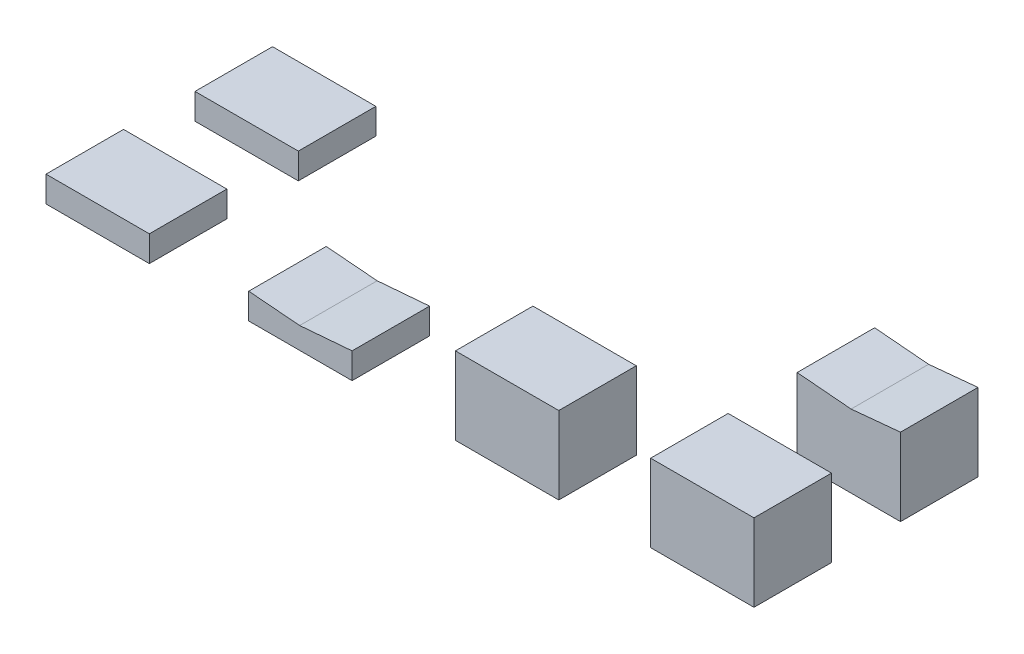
ISO-10303-21;
HEADER;
FILE_DESCRIPTION(('STEP AP214'),'2;1');
FILE_NAME('part.step','',(''),(''),'','','');
FILE_SCHEMA(('AUTOMOTIVE_DESIGN { 1 0 10303 214 1 1 1 1 }'));
ENDSEC;
DATA;
#1=APPLICATION_CONTEXT('core data for automotive mechanical design processes');
#2=APPLICATION_PROTOCOL_DEFINITION('international standard','automotive_design',2000,#1);
#3=PRODUCT_CONTEXT('',#1,'mechanical');
#4=PRODUCT('Part','Part','',(#3));
#5=PRODUCT_RELATED_PRODUCT_CATEGORY('part','',(#4));
#6=PRODUCT_DEFINITION_FORMATION('','',#4);
#7=PRODUCT_DEFINITION_CONTEXT('part definition',#1,'design');
#8=PRODUCT_DEFINITION('design','',#6,#7);
#9=PRODUCT_DEFINITION_SHAPE('','',#8);
#10=(LENGTH_UNIT() NAMED_UNIT(*) SI_UNIT(.MILLI.,.METRE.));
#11=(NAMED_UNIT(*) PLANE_ANGLE_UNIT() SI_UNIT($,.RADIAN.));
#12=(NAMED_UNIT(*) SI_UNIT($,.STERADIAN.) SOLID_ANGLE_UNIT());
#13=UNCERTAINTY_MEASURE_WITH_UNIT(LENGTH_MEASURE(1.E-05),#10,'distance_accuracy_value','');
#14=(GEOMETRIC_REPRESENTATION_CONTEXT(3) GLOBAL_UNCERTAINTY_ASSIGNED_CONTEXT((#13)) GLOBAL_UNIT_ASSIGNED_CONTEXT((#10,
#11,#12)) REPRESENTATION_CONTEXT('',''));
#15=CARTESIAN_POINT('',(0.,0.,0.));
#16=DIRECTION('',(0.,0.,1.));
#17=DIRECTION('',(1.,0.,0.));
#18=AXIS2_PLACEMENT_3D('',#15,#16,#17);
#19=CARTESIAN_POINT('',(-286.814270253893,50.,-357.799816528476));
#20=DIRECTION('',(-1.,0.,0.));
#21=DIRECTION('',(0.,0.,1.));
#22=AXIS2_PLACEMENT_3D('',#19,#20,#21);
#23=PLANE('',#22);
#24=DIRECTION('',(0.,0.,-1.));
#25=VECTOR('',#24,1.);
#26=CARTESIAN_POINT('',(-286.814270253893,0.,-357.799816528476));
#27=LINE('',#26,#25);
#28=CARTESIAN_POINT('',(-286.814270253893,0.,-207.799816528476));
#29=VERTEX_POINT('',#28);
#30=CARTESIAN_POINT('',(-286.814270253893,0.,-357.799816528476));
#31=VERTEX_POINT('',#30);
#32=EDGE_CURVE('E135',#29,#31,#27,.T.);
#33=ORIENTED_EDGE('',*,*,#32,.T.);
#34=DIRECTION('',(0.,-1.,0.));
#35=VECTOR('',#34,1.);
#36=CARTESIAN_POINT('',(-286.814270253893,50.,-357.799816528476));
#37=LINE('',#36,#35);
#38=CARTESIAN_POINT('',(-286.814270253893,50.,-357.799816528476));
#39=VERTEX_POINT('',#38);
#40=EDGE_CURVE('E12',#39,#31,#37,.T.);
#41=ORIENTED_EDGE('',*,*,#40,.F.);
#42=DIRECTION('',(0.,0.,-1.));
#43=VECTOR('',#42,1.);
#44=CARTESIAN_POINT('',(-286.814270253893,50.,-357.799816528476));
#45=LINE('',#44,#43);
#46=CARTESIAN_POINT('',(-286.814270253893,50.,-207.799816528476));
#47=VERTEX_POINT('',#46);
#48=EDGE_CURVE('E110',#47,#39,#45,.T.);
#49=ORIENTED_EDGE('',*,*,#48,.F.);
#50=DIRECTION('',(0.,-1.,0.));
#51=VECTOR('',#50,1.);
#52=CARTESIAN_POINT('',(-286.814270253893,50.,-207.799816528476));
#53=LINE('',#52,#51);
#54=EDGE_CURVE('E117',#47,#29,#53,.T.);
#55=ORIENTED_EDGE('',*,*,#54,.T.);
#56=EDGE_LOOP('',(#33,#41,#49,#55));
#57=FACE_BOUND('',#56,.T.);
#58=ADVANCED_FACE('F64',(#57),#23,.F.);
#59=CARTESIAN_POINT('',(-486.814270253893,50.,-357.799816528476));
#60=DIRECTION('',(0.,0.,1.));
#61=DIRECTION('',(1.,0.,0.));
#62=AXIS2_PLACEMENT_3D('',#59,#60,#61);
#63=PLANE('',#62);
#64=DIRECTION('',(-1.,0.,0.));
#65=VECTOR('',#64,1.);
#66=CARTESIAN_POINT('',(-486.814270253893,0.,-357.799816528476));
#67=LINE('',#66,#65);
#68=CARTESIAN_POINT('',(-486.814270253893,0.,-357.799816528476));
#69=VERTEX_POINT('',#68);
#70=EDGE_CURVE('E94',#31,#69,#67,.T.);
#71=ORIENTED_EDGE('',*,*,#70,.T.);
#72=DIRECTION('',(0.,-1.,0.));
#73=VECTOR('',#72,1.);
#74=CARTESIAN_POINT('',(-486.814270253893,50.,-357.799816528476));
#75=LINE('',#74,#73);
#76=CARTESIAN_POINT('',(-486.814270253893,50.,-357.799816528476));
#77=VERTEX_POINT('',#76);
#78=EDGE_CURVE('E72',#77,#69,#75,.T.);
#79=ORIENTED_EDGE('',*,*,#78,.F.);
#80=DIRECTION('',(-1.,0.,0.));
#81=VECTOR('',#80,1.);
#82=CARTESIAN_POINT('',(-486.814270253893,50.,-357.799816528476));
#83=LINE('',#82,#81);
#84=EDGE_CURVE('E80',#39,#77,#83,.T.);
#85=ORIENTED_EDGE('',*,*,#84,.F.);
#86=ORIENTED_EDGE('',*,*,#40,.T.);
#87=EDGE_LOOP('',(#71,#79,#85,#86));
#88=FACE_BOUND('',#87,.T.);
#89=ADVANCED_FACE('F146',(#88),#63,.F.);
#90=CARTESIAN_POINT('',(-486.814270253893,50.,-357.799816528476));
#91=DIRECTION('',(1.,0.,0.));
#92=DIRECTION('',(0.,0.,-1.));
#93=AXIS2_PLACEMENT_3D('',#90,#91,#92);
#94=PLANE('',#93);
#95=DIRECTION('',(0.,0.,1.));
#96=VECTOR('',#95,1.);
#97=CARTESIAN_POINT('',(-486.814270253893,0.,-357.799816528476));
#98=LINE('',#97,#96);
#99=CARTESIAN_POINT('',(-486.814270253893,0.,-207.799816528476));
#100=VERTEX_POINT('',#99);
#101=EDGE_CURVE('E128',#69,#100,#98,.T.);
#102=ORIENTED_EDGE('',*,*,#101,.T.);
#103=DIRECTION('',(0.,-1.,0.));
#104=VECTOR('',#103,1.);
#105=CARTESIAN_POINT('',(-486.814270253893,50.,-207.799816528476));
#106=LINE('',#105,#104);
#107=CARTESIAN_POINT('',(-486.814270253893,50.,-207.799816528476));
#108=VERTEX_POINT('',#107);
#109=EDGE_CURVE('E66',#108,#100,#106,.T.);
#110=ORIENTED_EDGE('',*,*,#109,.F.);
#111=DIRECTION('',(0.,0.,1.));
#112=VECTOR('',#111,1.);
#113=CARTESIAN_POINT('',(-486.814270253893,50.,-357.799816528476));
#114=LINE('',#113,#112);
#115=EDGE_CURVE('E103',#77,#108,#114,.T.);
#116=ORIENTED_EDGE('',*,*,#115,.F.);
#117=ORIENTED_EDGE('',*,*,#78,.T.);
#118=EDGE_LOOP('',(#102,#110,#116,#117));
#119=FACE_BOUND('',#118,.T.);
#120=ADVANCED_FACE('F144',(#119),#94,.F.);
#121=CARTESIAN_POINT('',(-486.814270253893,50.,-207.799816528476));
#122=DIRECTION('',(0.,0.,-1.));
#123=DIRECTION('',(-1.,0.,0.));
#124=AXIS2_PLACEMENT_3D('',#121,#122,#123);
#125=PLANE('',#124);
#126=DIRECTION('',(1.,0.,0.));
#127=VECTOR('',#126,1.);
#128=CARTESIAN_POINT('',(-486.814270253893,0.,-207.799816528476));
#129=LINE('',#128,#127);
#130=EDGE_CURVE('E120',#100,#29,#129,.T.);
#131=ORIENTED_EDGE('',*,*,#130,.T.);
#132=ORIENTED_EDGE('',*,*,#54,.F.);
#133=DIRECTION('',(1.,0.,0.));
#134=VECTOR('',#133,1.);
#135=CARTESIAN_POINT('',(-486.814270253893,50.,-207.799816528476));
#136=LINE('',#135,#134);
#137=EDGE_CURVE('E106',#108,#47,#136,.T.);
#138=ORIENTED_EDGE('',*,*,#137,.F.);
#139=ORIENTED_EDGE('',*,*,#109,.T.);
#140=EDGE_LOOP('',(#131,#132,#138,#139));
#141=FACE_BOUND('',#140,.T.);
#142=ADVANCED_FACE('F118',(#141),#125,.F.);
#143=CARTESIAN_POINT('',(0.,50.,0.));
#144=DIRECTION('',(0.,1.,0.));
#145=DIRECTION('',(0.,0.,1.));
#146=AXIS2_PLACEMENT_3D('',#143,#144,#145);
#147=PLANE('',#146);
#148=ORIENTED_EDGE('',*,*,#48,.T.);
#149=ORIENTED_EDGE('',*,*,#84,.T.);
#150=ORIENTED_EDGE('',*,*,#115,.T.);
#151=ORIENTED_EDGE('',*,*,#137,.T.);
#152=EDGE_LOOP('',(#148,#149,#150,#151));
#153=FACE_BOUND('',#152,.T.);
#154=ADVANCED_FACE('F108',(#153),#147,.T.);
#155=OPEN_SHELL('',(#58,#89,#120,#142,#154));
#156=SHELL_BASED_SURFACE_MODEL('B2',(#155));
#157=CARTESIAN_POINT('',(500.,150.,75.));
#158=DIRECTION('',(-1.,0.,0.));
#159=DIRECTION('',(0.,0.,1.));
#160=AXIS2_PLACEMENT_3D('',#157,#158,#159);
#161=PLANE('',#160);
#162=DIRECTION('',(0.,0.,-1.));
#163=VECTOR('',#162,1.);
#164=CARTESIAN_POINT('',(500.,0.,75.));
#165=LINE('',#164,#163);
#166=CARTESIAN_POINT('',(500.,0.,75.));
#167=VERTEX_POINT('',#166);
#168=CARTESIAN_POINT('',(500.,0.,-75.));
#169=VERTEX_POINT('',#168);
#170=EDGE_CURVE('E280',#167,#169,#165,.T.);
#171=ORIENTED_EDGE('',*,*,#170,.T.);
#172=DIRECTION('',(0.,-1.,0.));
#173=VECTOR('',#172,1.);
#174=CARTESIAN_POINT('',(500.,150.,-75.));
#175=LINE('',#174,#173);
#176=CARTESIAN_POINT('',(500.,150.,-75.));
#177=VERTEX_POINT('',#176);
#178=EDGE_CURVE('E62',#177,#169,#175,.T.);
#179=ORIENTED_EDGE('',*,*,#178,.F.);
#180=DIRECTION('',(0.,0.,-1.));
#181=VECTOR('',#180,1.);
#182=CARTESIAN_POINT('',(500.,150.,75.));
#183=LINE('',#182,#181);
#184=CARTESIAN_POINT('',(500.,150.,75.));
#185=VERTEX_POINT('',#184);
#186=EDGE_CURVE('E270',#185,#177,#183,.T.);
#187=ORIENTED_EDGE('',*,*,#186,.F.);
#188=DIRECTION('',(0.,-1.,0.));
#189=VECTOR('',#188,1.);
#190=CARTESIAN_POINT('',(500.,150.,75.));
#191=LINE('',#190,#189);
#192=EDGE_CURVE('E207',#185,#167,#191,.T.);
#193=ORIENTED_EDGE('',*,*,#192,.T.);
#194=EDGE_LOOP('',(#171,#179,#187,#193));
#195=FACE_BOUND('',#194,.T.);
#196=ADVANCED_FACE('F205',(#195),#161,.F.);
#197=CARTESIAN_POINT('',(500.,150.,-75.));
#198=DIRECTION('',(0.,0.,1.));
#199=DIRECTION('',(1.,0.,0.));
#200=AXIS2_PLACEMENT_3D('',#197,#198,#199);
#201=PLANE('',#200);
#202=DIRECTION('',(-1.,0.,0.));
#203=VECTOR('',#202,1.);
#204=CARTESIAN_POINT('',(500.,0.,-75.));
#205=LINE('',#204,#203);
#206=CARTESIAN_POINT('',(300.,0.,-75.));
#207=VERTEX_POINT('',#206);
#208=EDGE_CURVE('E235',#169,#207,#205,.T.);
#209=ORIENTED_EDGE('',*,*,#208,.T.);
#210=DIRECTION('',(0.,-1.,0.));
#211=VECTOR('',#210,1.);
#212=CARTESIAN_POINT('',(300.,150.,-75.));
#213=LINE('',#212,#211);
#214=CARTESIAN_POINT('',(300.,150.,-75.));
#215=VERTEX_POINT('',#214);
#216=EDGE_CURVE('E213',#215,#207,#213,.T.);
#217=ORIENTED_EDGE('',*,*,#216,.F.);
#218=DIRECTION('',(-1.,0.,0.));
#219=VECTOR('',#218,1.);
#220=CARTESIAN_POINT('',(500.,150.,-75.));
#221=LINE('',#220,#219);
#222=EDGE_CURVE('E221',#177,#215,#221,.T.);
#223=ORIENTED_EDGE('',*,*,#222,.F.);
#224=ORIENTED_EDGE('',*,*,#178,.T.);
#225=EDGE_LOOP('',(#209,#217,#223,#224));
#226=FACE_BOUND('',#225,.T.);
#227=ADVANCED_FACE('F284',(#226),#201,.F.);
#228=CARTESIAN_POINT('',(300.,150.,75.));
#229=DIRECTION('',(-1.,0.,0.));
#230=DIRECTION('',(0.,0.,1.));
#231=AXIS2_PLACEMENT_3D('',#228,#229,#230);
#232=PLANE('',#231);
#233=DIRECTION('',(0.,0.,-1.));
#234=VECTOR('',#233,1.);
#235=CARTESIAN_POINT('',(300.,0.,75.));
#236=LINE('',#235,#234);
#237=CARTESIAN_POINT('',(300.,0.,75.));
#238=VERTEX_POINT('',#237);
#239=EDGE_CURVE('E254',#238,#207,#236,.T.);
#240=ORIENTED_EDGE('',*,*,#239,.F.);
#241=DIRECTION('',(0.,-1.,0.));
#242=VECTOR('',#241,1.);
#243=CARTESIAN_POINT('',(300.,150.,75.));
#244=LINE('',#243,#242);
#245=CARTESIAN_POINT('',(300.,150.,75.));
#246=VERTEX_POINT('',#245);
#247=EDGE_CURVE('E249',#246,#238,#244,.T.);
#248=ORIENTED_EDGE('',*,*,#247,.F.);
#249=DIRECTION('',(0.,0.,-1.));
#250=VECTOR('',#249,1.);
#251=CARTESIAN_POINT('',(300.,150.,75.));
#252=LINE('',#251,#250);
#253=EDGE_CURVE('E253',#246,#215,#252,.T.);
#254=ORIENTED_EDGE('',*,*,#253,.T.);
#255=ORIENTED_EDGE('',*,*,#216,.T.);
#256=EDGE_LOOP('',(#240,#248,#254,#255));
#257=FACE_BOUND('',#256,.T.);
#258=ADVANCED_FACE('F251',(#257),#232,.T.);
#259=CARTESIAN_POINT('',(500.,150.,75.));
#260=DIRECTION('',(0.,0.,1.));
#261=DIRECTION('',(1.,0.,0.));
#262=AXIS2_PLACEMENT_3D('',#259,#260,#261);
#263=PLANE('',#262);
#264=DIRECTION('',(-1.,0.,0.));
#265=VECTOR('',#264,1.);
#266=CARTESIAN_POINT('',(500.,0.,75.));
#267=LINE('',#266,#265);
#268=EDGE_CURVE('E273',#167,#238,#267,.T.);
#269=ORIENTED_EDGE('',*,*,#268,.F.);
#270=ORIENTED_EDGE('',*,*,#192,.F.);
#271=DIRECTION('',(-1.,0.,0.));
#272=VECTOR('',#271,1.);
#273=CARTESIAN_POINT('',(500.,150.,75.));
#274=LINE('',#273,#272);
#275=EDGE_CURVE('E260',#185,#246,#274,.T.);
#276=ORIENTED_EDGE('',*,*,#275,.T.);
#277=ORIENTED_EDGE('',*,*,#247,.T.);
#278=EDGE_LOOP('',(#269,#270,#276,#277));
#279=FACE_BOUND('',#278,.T.);
#280=ADVANCED_FACE('F263',(#279),#263,.T.);
#281=CARTESIAN_POINT('',(0.,150.,0.));
#282=DIRECTION('',(0.,1.,0.));
#283=DIRECTION('',(0.,0.,1.));
#284=AXIS2_PLACEMENT_3D('',#281,#282,#283);
#285=PLANE('',#284);
#286=ORIENTED_EDGE('',*,*,#186,.T.);
#287=ORIENTED_EDGE('',*,*,#222,.T.);
#288=ORIENTED_EDGE('',*,*,#253,.F.);
#289=ORIENTED_EDGE('',*,*,#275,.F.);
#290=EDGE_LOOP('',(#286,#287,#288,#289));
#291=FACE_BOUND('',#290,.T.);
#292=ADVANCED_FACE('F259',(#291),#285,.T.);
#293=OPEN_SHELL('',(#196,#227,#258,#280,#292));
#294=SHELL_BASED_SURFACE_MODEL('B6',(#293));
#295=CARTESIAN_POINT('',(-292.356249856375,50.,-75.));
#296=DIRECTION('',(-1.,0.,0.));
#297=DIRECTION('',(0.,0.,1.));
#298=AXIS2_PLACEMENT_3D('',#295,#296,#297);
#299=PLANE('',#298);
#300=DIRECTION('',(0.,0.,-1.));
#301=VECTOR('',#300,1.);
#302=CARTESIAN_POINT('',(-292.356249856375,0.,-75.));
#303=LINE('',#302,#301);
#304=CARTESIAN_POINT('',(-292.356249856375,0.,75.));
#305=VERTEX_POINT('',#304);
#306=CARTESIAN_POINT('',(-292.356249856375,0.,-75.));
#307=VERTEX_POINT('',#306);
#308=EDGE_CURVE('E480',#305,#307,#303,.T.);
#309=ORIENTED_EDGE('',*,*,#308,.T.);
#310=DIRECTION('',(0.,-1.,0.));
#311=VECTOR('',#310,1.);
#312=CARTESIAN_POINT('',(-292.356249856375,50.,-75.));
#313=LINE('',#312,#311);
#314=CARTESIAN_POINT('',(-292.356249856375,50.,-75.));
#315=VERTEX_POINT('',#314);
#316=EDGE_CURVE('E344',#315,#307,#313,.T.);
#317=ORIENTED_EDGE('',*,*,#316,.F.);
#318=DIRECTION('',(0.,0.,-1.));
#319=VECTOR('',#318,1.);
#320=CARTESIAN_POINT('',(-292.356249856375,50.,-75.));
#321=LINE('',#320,#319);
#322=CARTESIAN_POINT('',(-292.356249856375,50.,75.));
#323=VERTEX_POINT('',#322);
#324=EDGE_CURVE('E455',#323,#315,#321,.T.);
#325=ORIENTED_EDGE('',*,*,#324,.F.);
#326=DIRECTION('',(0.,-1.,0.));
#327=VECTOR('',#326,1.);
#328=CARTESIAN_POINT('',(-292.356249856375,50.,75.));
#329=LINE('',#328,#327);
#330=EDGE_CURVE('E462',#323,#305,#329,.T.);
#331=ORIENTED_EDGE('',*,*,#330,.T.);
#332=EDGE_LOOP('',(#309,#317,#325,#331));
#333=FACE_BOUND('',#332,.T.);
#334=ADVANCED_FACE('F409',(#333),#299,.F.);
#335=CARTESIAN_POINT('',(-492.356249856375,50.,-75.));
#336=DIRECTION('',(0.,0.,1.));
#337=DIRECTION('',(1.,0.,0.));
#338=AXIS2_PLACEMENT_3D('',#335,#336,#337);
#339=PLANE('',#338);
#340=DIRECTION('',(-1.,0.,0.));
#341=VECTOR('',#340,1.);
#342=CARTESIAN_POINT('',(-492.356249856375,0.,-75.));
#343=LINE('',#342,#341);
#344=CARTESIAN_POINT('',(-492.356249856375,0.,-75.));
#345=VERTEX_POINT('',#344);
#346=EDGE_CURVE('E439',#307,#345,#343,.T.);
#347=ORIENTED_EDGE('',*,*,#346,.T.);
#348=DIRECTION('',(0.,-1.,0.));
#349=VECTOR('',#348,1.);
#350=CARTESIAN_POINT('',(-492.356249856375,50.,-75.));
#351=LINE('',#350,#349);
#352=CARTESIAN_POINT('',(-492.356249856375,50.,-75.));
#353=VERTEX_POINT('',#352);
#354=EDGE_CURVE('E417',#353,#345,#351,.T.);
#355=ORIENTED_EDGE('',*,*,#354,.F.);
#356=DIRECTION('',(-1.,0.,0.));
#357=VECTOR('',#356,1.);
#358=CARTESIAN_POINT('',(-492.356249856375,50.,-75.));
#359=LINE('',#358,#357);
#360=EDGE_CURVE('E425',#315,#353,#359,.T.);
#361=ORIENTED_EDGE('',*,*,#360,.F.);
#362=ORIENTED_EDGE('',*,*,#316,.T.);
#363=EDGE_LOOP('',(#347,#355,#361,#362));
#364=FACE_BOUND('',#363,.T.);
#365=ADVANCED_FACE('F491',(#364),#339,.F.);
#366=CARTESIAN_POINT('',(-492.356249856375,50.,-75.));
#367=DIRECTION('',(1.,0.,0.));
#368=DIRECTION('',(0.,0.,-1.));
#369=AXIS2_PLACEMENT_3D('',#366,#367,#368);
#370=PLANE('',#369);
#371=DIRECTION('',(0.,0.,1.));
#372=VECTOR('',#371,1.);
#373=CARTESIAN_POINT('',(-492.356249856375,0.,-75.));
#374=LINE('',#373,#372);
#375=CARTESIAN_POINT('',(-492.356249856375,0.,75.));
#376=VERTEX_POINT('',#375);
#377=EDGE_CURVE('E473',#345,#376,#374,.T.);
#378=ORIENTED_EDGE('',*,*,#377,.T.);
#379=DIRECTION('',(0.,-1.,0.));
#380=VECTOR('',#379,1.);
#381=CARTESIAN_POINT('',(-492.356249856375,50.,75.));
#382=LINE('',#381,#380);
#383=CARTESIAN_POINT('',(-492.356249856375,50.,75.));
#384=VERTEX_POINT('',#383);
#385=EDGE_CURVE('E411',#384,#376,#382,.T.);
#386=ORIENTED_EDGE('',*,*,#385,.F.);
#387=DIRECTION('',(0.,0.,1.));
#388=VECTOR('',#387,1.);
#389=CARTESIAN_POINT('',(-492.356249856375,50.,-75.));
#390=LINE('',#389,#388);
#391=EDGE_CURVE('E448',#353,#384,#390,.T.);
#392=ORIENTED_EDGE('',*,*,#391,.F.);
#393=ORIENTED_EDGE('',*,*,#354,.T.);
#394=EDGE_LOOP('',(#378,#386,#392,#393));
#395=FACE_BOUND('',#394,.T.);
#396=ADVANCED_FACE('F488',(#395),#370,.F.);
#397=CARTESIAN_POINT('',(-492.356249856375,50.,75.));
#398=DIRECTION('',(0.,0.,-1.));
#399=DIRECTION('',(-1.,0.,0.));
#400=AXIS2_PLACEMENT_3D('',#397,#398,#399);
#401=PLANE('',#400);
#402=DIRECTION('',(1.,0.,0.));
#403=VECTOR('',#402,1.);
#404=CARTESIAN_POINT('',(-492.356249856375,0.,75.));
#405=LINE('',#404,#403);
#406=EDGE_CURVE('E465',#376,#305,#405,.T.);
#407=ORIENTED_EDGE('',*,*,#406,.T.);
#408=ORIENTED_EDGE('',*,*,#330,.F.);
#409=DIRECTION('',(1.,0.,0.));
#410=VECTOR('',#409,1.);
#411=CARTESIAN_POINT('',(-492.356249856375,50.,75.));
#412=LINE('',#411,#410);
#413=EDGE_CURVE('E451',#384,#323,#412,.T.);
#414=ORIENTED_EDGE('',*,*,#413,.F.);
#415=ORIENTED_EDGE('',*,*,#385,.T.);
#416=EDGE_LOOP('',(#407,#408,#414,#415));
#417=FACE_BOUND('',#416,.T.);
#418=ADVANCED_FACE('F463',(#417),#401,.F.);
#419=CARTESIAN_POINT('',(0.,50.,0.));
#420=DIRECTION('',(0.,1.,0.));
#421=DIRECTION('',(0.,0.,1.));
#422=AXIS2_PLACEMENT_3D('',#419,#420,#421);
#423=PLANE('',#422);
#424=ORIENTED_EDGE('',*,*,#324,.T.);
#425=ORIENTED_EDGE('',*,*,#360,.T.);
#426=ORIENTED_EDGE('',*,*,#391,.T.);
#427=ORIENTED_EDGE('',*,*,#413,.T.);
#428=EDGE_LOOP('',(#424,#425,#426,#427));
#429=FACE_BOUND('',#428,.T.);
#430=ADVANCED_FACE('F453',(#429),#423,.T.);
#431=OPEN_SHELL('',(#334,#365,#396,#418,#430));
#432=SHELL_BASED_SURFACE_MODEL('B197',(#431));
#433=CARTESIAN_POINT('',(866.922575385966,150.,-369.381837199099));
#434=DIRECTION('',(-1.,0.,0.));
#435=DIRECTION('',(0.,0.,1.));
#436=AXIS2_PLACEMENT_3D('',#433,#434,#435);
#437=PLANE('',#436);
#438=DIRECTION('',(0.,0.,-1.));
#439=VECTOR('',#438,1.);
#440=CARTESIAN_POINT('',(866.922575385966,0.,-369.381837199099));
#441=LINE('',#440,#439);
#442=CARTESIAN_POINT('',(866.922575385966,0.,-219.381837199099));
#443=VERTEX_POINT('',#442);
#444=CARTESIAN_POINT('',(866.922575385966,0.,-369.381837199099));
#445=VERTEX_POINT('',#444);
#446=EDGE_CURVE('E800',#443,#445,#441,.T.);
#447=ORIENTED_EDGE('',*,*,#446,.T.);
#448=DIRECTION('',(0.,-1.,0.));
#449=VECTOR('',#448,1.);
#450=CARTESIAN_POINT('',(866.922575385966,150.,-369.381837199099));
#451=LINE('',#450,#449);
#452=CARTESIAN_POINT('',(866.922575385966,150.,-369.381837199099));
#453=VERTEX_POINT('',#452);
#454=EDGE_CURVE('E674',#453,#445,#451,.T.);
#455=ORIENTED_EDGE('',*,*,#454,.F.);
#456=DIRECTION('',(0.,0.,-1.));
#457=VECTOR('',#456,1.);
#458=CARTESIAN_POINT('',(866.922575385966,150.,-369.381837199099));
#459=LINE('',#458,#457);
#460=CARTESIAN_POINT('',(866.922575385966,150.,-219.381837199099));
#461=VERTEX_POINT('',#460);
#462=EDGE_CURVE('E802',#461,#453,#459,.T.);
#463=ORIENTED_EDGE('',*,*,#462,.F.);
#464=DIRECTION('',(0.,-1.,0.));
#465=VECTOR('',#464,1.);
#466=CARTESIAN_POINT('',(866.922575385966,150.,-219.381837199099));
#467=LINE('',#466,#465);
#468=EDGE_CURVE('E795',#461,#443,#467,.T.);
#469=ORIENTED_EDGE('',*,*,#468,.T.);
#470=EDGE_LOOP('',(#447,#455,#463,#469));
#471=FACE_BOUND('',#470,.T.);
#472=ADVANCED_FACE('F739',(#471),#437,.F.);
#473=CARTESIAN_POINT('',(666.922575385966,150.,-369.381837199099));
#474=DIRECTION('',(0.,0.,1.));
#475=DIRECTION('',(1.,0.,0.));
#476=AXIS2_PLACEMENT_3D('',#473,#474,#475);
#477=PLANE('',#476);
#478=DIRECTION('',(0.996253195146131,-0.0864845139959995,0.));
#479=VECTOR('',#478,1.);
#480=CARTESIAN_POINT('',(666.922575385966,150.,-369.381837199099));
#481=LINE('',#480,#479);
#482=CARTESIAN_POINT('',(666.922575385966,150.,-369.381837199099));
#483=VERTEX_POINT('',#482);
#484=CARTESIAN_POINT('',(771.327173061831,140.936660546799,-369.381837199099));
#485=VERTEX_POINT('',#484);
#486=EDGE_CURVE('E755',#483,#485,#481,.T.);
#487=ORIENTED_EDGE('',*,*,#486,.T.);
#488=DIRECTION('',(0.995535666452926,0.0943861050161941,0.));
#489=VECTOR('',#488,1.);
#490=CARTESIAN_POINT('',(771.327173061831,140.936660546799,-369.381837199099));
#491=LINE('',#490,#489);
#492=EDGE_CURVE('E817',#485,#453,#491,.T.);
#493=ORIENTED_EDGE('',*,*,#492,.T.);
#494=ORIENTED_EDGE('',*,*,#454,.T.);
#495=DIRECTION('',(-1.,0.,0.));
#496=VECTOR('',#495,1.);
#497=CARTESIAN_POINT('',(666.922575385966,0.,-369.381837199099));
#498=LINE('',#497,#496);
#499=CARTESIAN_POINT('',(666.922575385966,0.,-369.381837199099));
#500=VERTEX_POINT('',#499);
#501=EDGE_CURVE('E784',#445,#500,#498,.T.);
#502=ORIENTED_EDGE('',*,*,#501,.T.);
#503=DIRECTION('',(0.,-1.,0.));
#504=VECTOR('',#503,1.);
#505=CARTESIAN_POINT('',(666.922575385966,150.,-369.381837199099));
#506=LINE('',#505,#504);
#507=EDGE_CURVE('E748',#483,#500,#506,.T.);
#508=ORIENTED_EDGE('',*,*,#507,.F.);
#509=EDGE_LOOP('',(#487,#493,#494,#502,#508));
#510=FACE_BOUND('',#509,.T.);
#511=ADVANCED_FACE('F844',(#510),#477,.F.);
#512=CARTESIAN_POINT('',(666.922575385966,150.,-369.381837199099));
#513=DIRECTION('',(1.,0.,0.));
#514=DIRECTION('',(0.,0.,-1.));
#515=AXIS2_PLACEMENT_3D('',#512,#513,#514);
#516=PLANE('',#515);
#517=DIRECTION('',(0.,0.,1.));
#518=VECTOR('',#517,1.);
#519=CARTESIAN_POINT('',(666.922575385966,0.,-369.381837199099));
#520=LINE('',#519,#518);
#521=CARTESIAN_POINT('',(666.922575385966,0.,-219.381837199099));
#522=VERTEX_POINT('',#521);
#523=EDGE_CURVE('E774',#500,#522,#520,.T.);
#524=ORIENTED_EDGE('',*,*,#523,.T.);
#525=DIRECTION('',(0.,-1.,0.));
#526=VECTOR('',#525,1.);
#527=CARTESIAN_POINT('',(666.922575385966,150.,-219.381837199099));
#528=LINE('',#527,#526);
#529=CARTESIAN_POINT('',(666.922575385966,150.,-219.381837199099));
#530=VERTEX_POINT('',#529);
#531=EDGE_CURVE('E779',#530,#522,#528,.T.);
#532=ORIENTED_EDGE('',*,*,#531,.F.);
#533=DIRECTION('',(0.,0.,1.));
#534=VECTOR('',#533,1.);
#535=CARTESIAN_POINT('',(666.922575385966,150.,-369.381837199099));
#536=LINE('',#535,#534);
#537=EDGE_CURVE('E807',#483,#530,#536,.T.);
#538=ORIENTED_EDGE('',*,*,#537,.F.);
#539=ORIENTED_EDGE('',*,*,#507,.T.);
#540=EDGE_LOOP('',(#524,#532,#538,#539));
#541=FACE_BOUND('',#540,.T.);
#542=ADVANCED_FACE('F776',(#541),#516,.F.);
#543=CARTESIAN_POINT('',(666.922575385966,150.,-219.381837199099));
#544=DIRECTION('',(0.,0.,-1.));
#545=DIRECTION('',(-1.,0.,0.));
#546=AXIS2_PLACEMENT_3D('',#543,#544,#545);
#547=PLANE('',#546);
#548=ORIENTED_EDGE('',*,*,#468,.F.);
#549=DIRECTION('',(0.995535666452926,0.0943861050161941,0.));
#550=VECTOR('',#549,1.);
#551=CARTESIAN_POINT('',(771.327173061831,140.936660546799,-219.381837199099));
#552=LINE('',#551,#550);
#553=CARTESIAN_POINT('',(771.327173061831,140.936660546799,-219.381837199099));
#554=VERTEX_POINT('',#553);
#555=EDGE_CURVE('E828',#554,#461,#552,.T.);
#556=ORIENTED_EDGE('',*,*,#555,.F.);
#557=DIRECTION('',(0.996253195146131,-0.0864845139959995,0.));
#558=VECTOR('',#557,1.);
#559=CARTESIAN_POINT('',(666.922575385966,150.,-219.381837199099));
#560=LINE('',#559,#558);
#561=EDGE_CURVE('E793',#530,#554,#560,.T.);
#562=ORIENTED_EDGE('',*,*,#561,.F.);
#563=ORIENTED_EDGE('',*,*,#531,.T.);
#564=DIRECTION('',(1.,0.,0.));
#565=VECTOR('',#564,1.);
#566=CARTESIAN_POINT('',(666.922575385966,0.,-219.381837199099));
#567=LINE('',#566,#565);
#568=EDGE_CURVE('E783',#522,#443,#567,.T.);
#569=ORIENTED_EDGE('',*,*,#568,.T.);
#570=EDGE_LOOP('',(#548,#556,#562,#563,#569));
#571=FACE_BOUND('',#570,.T.);
#572=ADVANCED_FACE('F789',(#571),#547,.F.);
#573=CARTESIAN_POINT('',(0.,0.,0.));
#574=DIRECTION('',(0.,1.,0.));
#575=DIRECTION('',(0.,0.,1.));
#576=AXIS2_PLACEMENT_3D('',#573,#574,#575);
#577=PLANE('',#576);
#578=ORIENTED_EDGE('',*,*,#446,.F.);
#579=ORIENTED_EDGE('',*,*,#568,.F.);
#580=ORIENTED_EDGE('',*,*,#523,.F.);
#581=ORIENTED_EDGE('',*,*,#501,.F.);
#582=EDGE_LOOP('',(#578,#579,#580,#581));
#583=FACE_BOUND('',#582,.T.);
#584=ADVANCED_FACE('F798',(#583),#577,.F.);
#585=CARTESIAN_POINT('',(771.327173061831,140.936660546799,-369.381837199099));
#586=DIRECTION('',(0.0943861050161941,-0.995535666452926,0.));
#587=DIRECTION('',(0.995535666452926,0.0943861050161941,0.));
#588=AXIS2_PLACEMENT_3D('',#585,#586,#587);
#589=PLANE('',#588);
#590=ORIENTED_EDGE('',*,*,#555,.T.);
#591=ORIENTED_EDGE('',*,*,#462,.T.);
#592=ORIENTED_EDGE('',*,*,#492,.F.);
#593=DIRECTION('',(0.,0.,1.));
#594=VECTOR('',#593,1.);
#595=CARTESIAN_POINT('',(771.327173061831,140.936660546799,-369.381837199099));
#596=LINE('',#595,#594);
#597=EDGE_CURVE('E816',#485,#554,#596,.T.);
#598=ORIENTED_EDGE('',*,*,#597,.T.);
#599=EDGE_LOOP('',(#590,#591,#592,#598));
#600=FACE_BOUND('',#599,.T.);
#601=ADVANCED_FACE('F835',(#600),#589,.F.);
#602=CARTESIAN_POINT('',(666.922575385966,150.,-369.381837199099));
#603=DIRECTION('',(-0.0864845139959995,-0.996253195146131,0.));
#604=DIRECTION('',(0.996253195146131,-0.0864845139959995,0.));
#605=AXIS2_PLACEMENT_3D('',#602,#603,#604);
#606=PLANE('',#605);
#607=ORIENTED_EDGE('',*,*,#561,.T.);
#608=ORIENTED_EDGE('',*,*,#597,.F.);
#609=ORIENTED_EDGE('',*,*,#486,.F.);
#610=ORIENTED_EDGE('',*,*,#537,.T.);
#611=EDGE_LOOP('',(#607,#608,#609,#610));
#612=FACE_BOUND('',#611,.T.);
#613=ADVANCED_FACE('F846',(#612),#606,.F.);
#614=CLOSED_SHELL('',(#472,#511,#542,#572,#584,#601,#613));
#615=MANIFOLD_SOLID_BREP('B605',#614);
#616=CARTESIAN_POINT('',(668.767186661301,150.,65.9807365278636));
#617=DIRECTION('',(1.,0.,0.));
#618=DIRECTION('',(0.,0.,-1.));
#619=AXIS2_PLACEMENT_3D('',#616,#617,#618);
#620=PLANE('',#619);
#621=DIRECTION('',(0.,0.,1.));
#622=VECTOR('',#621,1.);
#623=CARTESIAN_POINT('',(668.767186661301,0.,65.9807365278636));
#624=LINE('',#623,#622);
#625=CARTESIAN_POINT('',(668.767186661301,0.,-84.0192634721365));
#626=VERTEX_POINT('',#625);
#627=CARTESIAN_POINT('',(668.767186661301,0.,65.9807365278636));
#628=VERTEX_POINT('',#627);
#629=EDGE_CURVE('E990',#626,#628,#624,.T.);
#630=ORIENTED_EDGE('',*,*,#629,.T.);
#631=DIRECTION('',(0.,-1.,0.));
#632=VECTOR('',#631,1.);
#633=CARTESIAN_POINT('',(668.767186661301,150.,65.9807365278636));
#634=LINE('',#633,#632);
#635=CARTESIAN_POINT('',(668.767186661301,150.,65.9807365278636));
#636=VERTEX_POINT('',#635);
#637=EDGE_CURVE('E737',#636,#628,#634,.T.);
#638=ORIENTED_EDGE('',*,*,#637,.F.);
#639=DIRECTION('',(0.,0.,1.));
#640=VECTOR('',#639,1.);
#641=CARTESIAN_POINT('',(668.767186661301,150.,65.9807365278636));
#642=LINE('',#641,#640);
#643=CARTESIAN_POINT('',(668.767186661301,150.,-84.0192634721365));
#644=VERTEX_POINT('',#643);
#645=EDGE_CURVE('E972',#644,#636,#642,.T.);
#646=ORIENTED_EDGE('',*,*,#645,.F.);
#647=DIRECTION('',(0.,-1.,0.));
#648=VECTOR('',#647,1.);
#649=CARTESIAN_POINT('',(668.767186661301,150.,-84.0192634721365));
#650=LINE('',#649,#648);
#651=EDGE_CURVE('E986',#644,#626,#650,.T.);
#652=ORIENTED_EDGE('',*,*,#651,.T.);
#653=EDGE_LOOP('',(#630,#638,#646,#652));
#654=FACE_BOUND('',#653,.T.);
#655=ADVANCED_FACE('F920',(#654),#620,.F.);
#656=CARTESIAN_POINT('',(868.767186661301,150.,65.9807365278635));
#657=DIRECTION('',(0.,0.,-1.));
#658=DIRECTION('',(-1.,0.,0.));
#659=AXIS2_PLACEMENT_3D('',#656,#657,#658);
#660=PLANE('',#659);
#661=DIRECTION('',(1.,0.,0.));
#662=VECTOR('',#661,1.);
#663=CARTESIAN_POINT('',(868.767186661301,0.,65.9807365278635));
#664=LINE('',#663,#662);
#665=CARTESIAN_POINT('',(868.767186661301,0.,65.9807365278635));
#666=VERTEX_POINT('',#665);
#667=EDGE_CURVE('E977',#628,#666,#664,.T.);
#668=ORIENTED_EDGE('',*,*,#667,.T.);
#669=DIRECTION('',(0.,-1.,0.));
#670=VECTOR('',#669,1.);
#671=CARTESIAN_POINT('',(868.767186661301,150.,65.9807365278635));
#672=LINE('',#671,#670);
#673=CARTESIAN_POINT('',(868.767186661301,150.,65.9807365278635));
#674=VERTEX_POINT('',#673);
#675=EDGE_CURVE('E929',#674,#666,#672,.T.);
#676=ORIENTED_EDGE('',*,*,#675,.F.);
#677=DIRECTION('',(1.,0.,0.));
#678=VECTOR('',#677,1.);
#679=CARTESIAN_POINT('',(868.767186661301,150.,65.9807365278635));
#680=LINE('',#679,#678);
#681=EDGE_CURVE('E967',#636,#674,#680,.T.);
#682=ORIENTED_EDGE('',*,*,#681,.F.);
#683=ORIENTED_EDGE('',*,*,#637,.T.);
#684=EDGE_LOOP('',(#668,#676,#682,#683));
#685=FACE_BOUND('',#684,.T.);
#686=ADVANCED_FACE('F976',(#685),#660,.F.);
#687=CARTESIAN_POINT('',(868.767186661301,150.,65.9807365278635));
#688=DIRECTION('',(-1.,0.,0.));
#689=DIRECTION('',(0.,0.,1.));
#690=AXIS2_PLACEMENT_3D('',#687,#688,#689);
#691=PLANE('',#690);
#692=DIRECTION('',(0.,0.,-1.));
#693=VECTOR('',#692,1.);
#694=CARTESIAN_POINT('',(868.767186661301,0.,65.9807365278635));
#695=LINE('',#694,#693);
#696=CARTESIAN_POINT('',(868.767186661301,0.,-84.0192634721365));
#697=VERTEX_POINT('',#696);
#698=EDGE_CURVE('E954',#666,#697,#695,.T.);
#699=ORIENTED_EDGE('',*,*,#698,.T.);
#700=DIRECTION('',(0.,-1.,0.));
#701=VECTOR('',#700,1.);
#702=CARTESIAN_POINT('',(868.767186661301,150.,-84.0192634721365));
#703=LINE('',#702,#701);
#704=CARTESIAN_POINT('',(868.767186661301,150.,-84.0192634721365));
#705=VERTEX_POINT('',#704);
#706=EDGE_CURVE('E979',#705,#697,#703,.T.);
#707=ORIENTED_EDGE('',*,*,#706,.F.);
#708=DIRECTION('',(0.,0.,-1.));
#709=VECTOR('',#708,1.);
#710=CARTESIAN_POINT('',(868.767186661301,150.,65.9807365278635));
#711=LINE('',#710,#709);
#712=EDGE_CURVE('E970',#674,#705,#711,.T.);
#713=ORIENTED_EDGE('',*,*,#712,.F.);
#714=ORIENTED_EDGE('',*,*,#675,.T.);
#715=EDGE_LOOP('',(#699,#707,#713,#714));
#716=FACE_BOUND('',#715,.T.);
#717=ADVANCED_FACE('F980',(#716),#691,.F.);
#718=CARTESIAN_POINT('',(868.767186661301,150.,-84.0192634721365));
#719=DIRECTION('',(0.,0.,1.));
#720=DIRECTION('',(1.,0.,0.));
#721=AXIS2_PLACEMENT_3D('',#718,#719,#720);
#722=PLANE('',#721);
#723=DIRECTION('',(-1.,0.,0.));
#724=VECTOR('',#723,1.);
#725=CARTESIAN_POINT('',(868.767186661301,0.,-84.0192634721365));
#726=LINE('',#725,#724);
#727=EDGE_CURVE('E960',#697,#626,#726,.T.);
#728=ORIENTED_EDGE('',*,*,#727,.T.);
#729=ORIENTED_EDGE('',*,*,#651,.F.);
#730=DIRECTION('',(-1.,0.,0.));
#731=VECTOR('',#730,1.);
#732=CARTESIAN_POINT('',(868.767186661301,150.,-84.0192634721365));
#733=LINE('',#732,#731);
#734=EDGE_CURVE('E937',#705,#644,#733,.T.);
#735=ORIENTED_EDGE('',*,*,#734,.F.);
#736=ORIENTED_EDGE('',*,*,#706,.T.);
#737=EDGE_LOOP('',(#728,#729,#735,#736));
#738=FACE_BOUND('',#737,.T.);
#739=ADVANCED_FACE('F1003',(#738),#722,.F.);
#740=CARTESIAN_POINT('',(0.,150.,0.));
#741=DIRECTION('',(0.,1.,0.));
#742=DIRECTION('',(0.,0.,1.));
#743=AXIS2_PLACEMENT_3D('',#740,#741,#742);
#744=PLANE('',#743);
#745=ORIENTED_EDGE('',*,*,#645,.T.);
#746=ORIENTED_EDGE('',*,*,#681,.T.);
#747=ORIENTED_EDGE('',*,*,#712,.T.);
#748=ORIENTED_EDGE('',*,*,#734,.T.);
#749=EDGE_LOOP('',(#745,#746,#747,#748));
#750=FACE_BOUND('',#749,.T.);
#751=ADVANCED_FACE('F968',(#750),#744,.T.);
#752=CARTESIAN_POINT('',(0.,0.,0.));
#753=DIRECTION('',(0.,1.,0.));
#754=DIRECTION('',(0.,0.,1.));
#755=AXIS2_PLACEMENT_3D('',#752,#753,#754);
#756=PLANE('',#755);
#757=ORIENTED_EDGE('',*,*,#629,.F.);
#758=ORIENTED_EDGE('',*,*,#727,.F.);
#759=ORIENTED_EDGE('',*,*,#698,.F.);
#760=ORIENTED_EDGE('',*,*,#667,.F.);
#761=EDGE_LOOP('',(#757,#758,#759,#760));
#762=FACE_BOUND('',#761,.T.);
#763=ADVANCED_FACE('F1006',(#762),#756,.F.);
#764=CLOSED_SHELL('',(#655,#686,#717,#739,#751,#763));
#765=MANIFOLD_SOLID_BREP('B668',#764);
#766=CARTESIAN_POINT('',(-100.,50.,75.));
#767=DIRECTION('',(1.,0.,0.));
#768=DIRECTION('',(0.,0.,-1.));
#769=AXIS2_PLACEMENT_3D('',#766,#767,#768);
#770=PLANE('',#769);
#771=DIRECTION('',(0.,0.,1.));
#772=VECTOR('',#771,1.);
#773=CARTESIAN_POINT('',(-100.,0.,75.));
#774=LINE('',#773,#772);
#775=CARTESIAN_POINT('',(-100.,0.,-75.));
#776=VERTEX_POINT('',#775);
#777=CARTESIAN_POINT('',(-100.,0.,75.));
#778=VERTEX_POINT('',#777);
#779=EDGE_CURVE('E1134',#776,#778,#774,.T.);
#780=ORIENTED_EDGE('',*,*,#779,.T.);
#781=DIRECTION('',(0.,-1.,0.));
#782=VECTOR('',#781,1.);
#783=CARTESIAN_POINT('',(-100.,50.,75.));
#784=LINE('',#783,#782);
#785=CARTESIAN_POINT('',(-100.,50.,75.));
#786=VERTEX_POINT('',#785);
#787=EDGE_CURVE('E918',#786,#778,#784,.T.);
#788=ORIENTED_EDGE('',*,*,#787,.F.);
#789=DIRECTION('',(0.,0.,1.));
#790=VECTOR('',#789,1.);
#791=CARTESIAN_POINT('',(-100.,50.,75.));
#792=LINE('',#791,#790);
#793=CARTESIAN_POINT('',(-100.,50.,-75.));
#794=VERTEX_POINT('',#793);
#795=EDGE_CURVE('E1136',#794,#786,#792,.T.);
#796=ORIENTED_EDGE('',*,*,#795,.F.);
#797=DIRECTION('',(0.,-1.,0.));
#798=VECTOR('',#797,1.);
#799=CARTESIAN_POINT('',(-100.,50.,-75.));
#800=LINE('',#799,#798);
#801=EDGE_CURVE('E1129',#794,#776,#800,.T.);
#802=ORIENTED_EDGE('',*,*,#801,.T.);
#803=EDGE_LOOP('',(#780,#788,#796,#802));
#804=FACE_BOUND('',#803,.T.);
#805=ADVANCED_FACE('F1074',(#804),#770,.F.);
#806=CARTESIAN_POINT('',(100.,50.,75.));
#807=DIRECTION('',(0.,0.,-1.));
#808=DIRECTION('',(-1.,0.,0.));
#809=AXIS2_PLACEMENT_3D('',#806,#807,#808);
#810=PLANE('',#809);
#811=DIRECTION('',(0.,-1.,0.));
#812=VECTOR('',#811,1.);
#813=CARTESIAN_POINT('',(100.,50.,75.));
#814=LINE('',#813,#812);
#815=CARTESIAN_POINT('',(100.,50.,75.));
#816=VERTEX_POINT('',#815);
#817=CARTESIAN_POINT('',(100.,0.,75.));
#818=VERTEX_POINT('',#817);
#819=EDGE_CURVE('E1083',#816,#818,#814,.T.);
#820=ORIENTED_EDGE('',*,*,#819,.F.);
#821=DIRECTION('',(0.996679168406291,0.0814287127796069,0.));
#822=VECTOR('',#821,1.);
#823=CARTESIAN_POINT('',(100.,50.,75.));
#824=LINE('',#823,#822);
#825=CARTESIAN_POINT('',(-1.44143026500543,41.712232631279,75.));
#826=VERTEX_POINT('',#825);
#827=EDGE_CURVE('E1149',#826,#816,#824,.T.);
#828=ORIENTED_EDGE('',*,*,#827,.F.);
#829=DIRECTION('',(0.996483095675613,-0.0837940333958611,0.));
#830=VECTOR('',#829,1.);
#831=CARTESIAN_POINT('',(-1.44143026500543,41.712232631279,75.));
#832=LINE('',#831,#830);
#833=EDGE_CURVE('E1147',#786,#826,#832,.T.);
#834=ORIENTED_EDGE('',*,*,#833,.F.);
#835=ORIENTED_EDGE('',*,*,#787,.T.);
#836=DIRECTION('',(1.,0.,0.));
#837=VECTOR('',#836,1.);
#838=CARTESIAN_POINT('',(100.,0.,75.));
#839=LINE('',#838,#837);
#840=EDGE_CURVE('E1120',#778,#818,#839,.T.);
#841=ORIENTED_EDGE('',*,*,#840,.T.);
#842=EDGE_LOOP('',(#820,#828,#834,#835,#841));
#843=FACE_BOUND('',#842,.T.);
#844=ADVANCED_FACE('F1169',(#843),#810,.F.);
#845=CARTESIAN_POINT('',(100.,50.,75.));
#846=DIRECTION('',(-1.,0.,0.));
#847=DIRECTION('',(0.,0.,1.));
#848=AXIS2_PLACEMENT_3D('',#845,#846,#847);
#849=PLANE('',#848);
#850=DIRECTION('',(0.,0.,-1.));
#851=VECTOR('',#850,1.);
#852=CARTESIAN_POINT('',(100.,0.,75.));
#853=LINE('',#852,#851);
#854=CARTESIAN_POINT('',(100.,0.,-75.));
#855=VERTEX_POINT('',#854);
#856=EDGE_CURVE('E1109',#818,#855,#853,.T.);
#857=ORIENTED_EDGE('',*,*,#856,.T.);
#858=DIRECTION('',(0.,-1.,0.));
#859=VECTOR('',#858,1.);
#860=CARTESIAN_POINT('',(100.,50.,-75.));
#861=LINE('',#860,#859);
#862=CARTESIAN_POINT('',(100.,50.,-75.));
#863=VERTEX_POINT('',#862);
#864=EDGE_CURVE('E1114',#863,#855,#861,.T.);
#865=ORIENTED_EDGE('',*,*,#864,.F.);
#866=DIRECTION('',(0.,0.,-1.));
#867=VECTOR('',#866,1.);
#868=CARTESIAN_POINT('',(100.,50.,75.));
#869=LINE('',#868,#867);
#870=EDGE_CURVE('E1141',#816,#863,#869,.T.);
#871=ORIENTED_EDGE('',*,*,#870,.F.);
#872=ORIENTED_EDGE('',*,*,#819,.T.);
#873=EDGE_LOOP('',(#857,#865,#871,#872));
#874=FACE_BOUND('',#873,.T.);
#875=ADVANCED_FACE('F1111',(#874),#849,.F.);
#876=CARTESIAN_POINT('',(100.,50.,-75.));
#877=DIRECTION('',(0.,0.,1.));
#878=DIRECTION('',(1.,0.,0.));
#879=AXIS2_PLACEMENT_3D('',#876,#877,#878);
#880=PLANE('',#879);
#881=DIRECTION('',(0.996483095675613,-0.0837940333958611,0.));
#882=VECTOR('',#881,1.);
#883=CARTESIAN_POINT('',(-1.44143026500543,41.712232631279,-75.));
#884=LINE('',#883,#882);
#885=CARTESIAN_POINT('',(-1.44143026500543,41.712232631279,-75.));
#886=VERTEX_POINT('',#885);
#887=EDGE_CURVE('E1090',#794,#886,#884,.T.);
#888=ORIENTED_EDGE('',*,*,#887,.T.);
#889=DIRECTION('',(0.996679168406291,0.0814287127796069,0.));
#890=VECTOR('',#889,1.);
#891=CARTESIAN_POINT('',(100.,50.,-75.));
#892=LINE('',#891,#890);
#893=EDGE_CURVE('E1127',#886,#863,#892,.T.);
#894=ORIENTED_EDGE('',*,*,#893,.T.);
#895=ORIENTED_EDGE('',*,*,#864,.T.);
#896=DIRECTION('',(-1.,0.,0.));
#897=VECTOR('',#896,1.);
#898=CARTESIAN_POINT('',(100.,0.,-75.));
#899=LINE('',#898,#897);
#900=EDGE_CURVE('E1119',#855,#776,#899,.T.);
#901=ORIENTED_EDGE('',*,*,#900,.T.);
#902=ORIENTED_EDGE('',*,*,#801,.F.);
#903=EDGE_LOOP('',(#888,#894,#895,#901,#902));
#904=FACE_BOUND('',#903,.T.);
#905=ADVANCED_FACE('F1124',(#904),#880,.F.);
#906=CARTESIAN_POINT('',(0.,0.,0.));
#907=DIRECTION('',(0.,1.,0.));
#908=DIRECTION('',(0.,0.,1.));
#909=AXIS2_PLACEMENT_3D('',#906,#907,#908);
#910=PLANE('',#909);
#911=ORIENTED_EDGE('',*,*,#779,.F.);
#912=ORIENTED_EDGE('',*,*,#900,.F.);
#913=ORIENTED_EDGE('',*,*,#856,.F.);
#914=ORIENTED_EDGE('',*,*,#840,.F.);
#915=EDGE_LOOP('',(#911,#912,#913,#914));
#916=FACE_BOUND('',#915,.T.);
#917=ADVANCED_FACE('F1132',(#916),#910,.F.);
#918=CARTESIAN_POINT('',(100.,50.,-75.));
#919=DIRECTION('',(0.0814287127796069,-0.996679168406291,0.));
#920=DIRECTION('',(0.996679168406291,0.0814287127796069,0.));
#921=AXIS2_PLACEMENT_3D('',#918,#919,#920);
#922=PLANE('',#921);
#923=ORIENTED_EDGE('',*,*,#827,.T.);
#924=ORIENTED_EDGE('',*,*,#870,.T.);
#925=ORIENTED_EDGE('',*,*,#893,.F.);
#926=DIRECTION('',(0.,0.,1.));
#927=VECTOR('',#926,1.);
#928=CARTESIAN_POINT('',(-1.44143026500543,41.712232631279,-75.));
#929=LINE('',#928,#927);
#930=EDGE_CURVE('E1160',#886,#826,#929,.T.);
#931=ORIENTED_EDGE('',*,*,#930,.T.);
#932=EDGE_LOOP('',(#923,#924,#925,#931));
#933=FACE_BOUND('',#932,.T.);
#934=ADVANCED_FACE('F1180',(#933),#922,.F.);
#935=CARTESIAN_POINT('',(-1.44143026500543,41.712232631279,-75.));
#936=DIRECTION('',(-0.0837940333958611,-0.996483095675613,0.));
#937=DIRECTION('',(0.996483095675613,-0.0837940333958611,0.));
#938=AXIS2_PLACEMENT_3D('',#935,#936,#937);
#939=PLANE('',#938);
#940=ORIENTED_EDGE('',*,*,#833,.T.);
#941=ORIENTED_EDGE('',*,*,#930,.F.);
#942=ORIENTED_EDGE('',*,*,#887,.F.);
#943=ORIENTED_EDGE('',*,*,#795,.T.);
#944=EDGE_LOOP('',(#940,#941,#942,#943));
#945=FACE_BOUND('',#944,.T.);
#946=ADVANCED_FACE('F1182',(#945),#939,.F.);
#947=CLOSED_SHELL('',(#805,#844,#875,#905,#917,#934,#946));
#948=MANIFOLD_SOLID_BREP('B731',#947);
#949=ADVANCED_BREP_SHAPE_REPRESENTATION('',(#18,#615,#765,#948),#14);
#950=MANIFOLD_SURFACE_SHAPE_REPRESENTATION('',(#18,#156,#294,#432),#14);
#951=SHAPE_REPRESENTATION('',(#18),#14);
#952=SHAPE_DEFINITION_REPRESENTATION(#9,#951);
#953=SHAPE_REPRESENTATION_RELATIONSHIP('','',#951,#949);
#954=SHAPE_REPRESENTATION_RELATIONSHIP('','',#951,#950);
ENDSEC;
END-ISO-10303-21;
